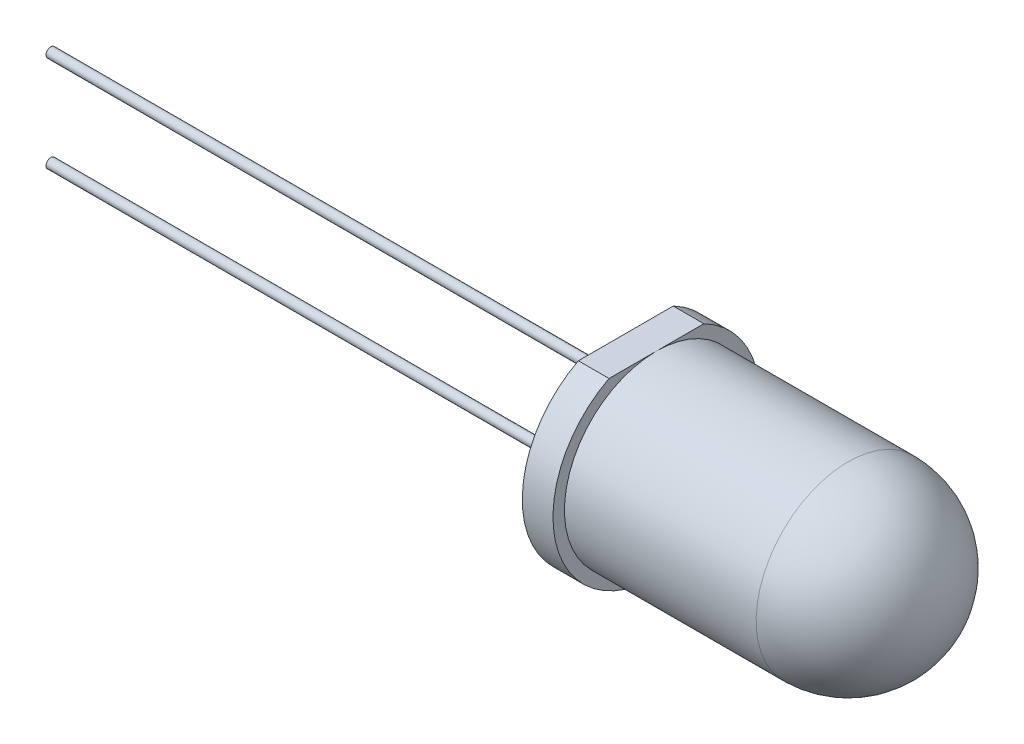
ISO-10303-21;
HEADER;
FILE_DESCRIPTION(('STEP AP214'),'2;1');
FILE_NAME('part.step','',(''),(''),'','','');
FILE_SCHEMA(('AUTOMOTIVE_DESIGN { 1 0 10303 214 1 1 1 1 }'));
ENDSEC;
DATA;
#1=APPLICATION_CONTEXT('core data for automotive mechanical design processes');
#2=APPLICATION_PROTOCOL_DEFINITION('international standard','automotive_design',2000,#1);
#3=PRODUCT_CONTEXT('',#1,'mechanical');
#4=PRODUCT('Part','Part','',(#3));
#5=PRODUCT_RELATED_PRODUCT_CATEGORY('part','',(#4));
#6=PRODUCT_DEFINITION_FORMATION('','',#4);
#7=PRODUCT_DEFINITION_CONTEXT('part definition',#1,'design');
#8=PRODUCT_DEFINITION('design','',#6,#7);
#9=PRODUCT_DEFINITION_SHAPE('','',#8);
#10=(LENGTH_UNIT() NAMED_UNIT(*) SI_UNIT(.MILLI.,.METRE.));
#11=(NAMED_UNIT(*) PLANE_ANGLE_UNIT() SI_UNIT($,.RADIAN.));
#12=(NAMED_UNIT(*) SI_UNIT($,.STERADIAN.) SOLID_ANGLE_UNIT());
#13=UNCERTAINTY_MEASURE_WITH_UNIT(LENGTH_MEASURE(1.E-05),#10,'distance_accuracy_value','');
#14=(GEOMETRIC_REPRESENTATION_CONTEXT(3) GLOBAL_UNCERTAINTY_ASSIGNED_CONTEXT((#13)) GLOBAL_UNIT_ASSIGNED_CONTEXT((#10,
#11,#12)) REPRESENTATION_CONTEXT('',''));
#15=CARTESIAN_POINT('',(0.,0.,0.));
#16=DIRECTION('',(0.,0.,1.));
#17=DIRECTION('',(1.,0.,0.));
#18=AXIS2_PLACEMENT_3D('',#15,#16,#17);
#19=CARTESIAN_POINT('',(-0.8,0.,0.));
#20=DIRECTION('',(1.,0.,0.));
#21=DIRECTION('',(0.,0.,-1.));
#22=AXIS2_PLACEMENT_3D('',#19,#20,#21);
#23=CYLINDRICAL_SURFACE('',#22,2.4);
#24=CARTESIAN_POINT('',(0.,0.,0.));
#25=DIRECTION('',(1.,0.,0.));
#26=DIRECTION('',(0.,0.,-1.));
#27=AXIS2_PLACEMENT_3D('',#24,#25,#26);
#28=CIRCLE('',#27,2.4);
#29=CARTESIAN_POINT('',(0.,2.4,0.));
#30=VERTEX_POINT('',#29);
#31=EDGE_CURVE('E95',#30,#30,#28,.T.);
#32=ORIENTED_EDGE('',*,*,#31,.T.);
#33=EDGE_LOOP('',(#32));
#34=FACE_BOUND('',#33,.T.);
#35=CARTESIAN_POINT('',(5.,0.,0.));
#36=DIRECTION('',(1.,0.,0.));
#37=DIRECTION('',(0.,0.,-1.));
#38=AXIS2_PLACEMENT_3D('',#35,#36,#37);
#39=CIRCLE('',#38,2.4);
#40=CARTESIAN_POINT('',(5.,0.,-2.4));
#41=VERTEX_POINT('',#40);
#42=EDGE_CURVE('E102',#41,#41,#39,.T.);
#43=ORIENTED_EDGE('',*,*,#42,.F.);
#44=EDGE_LOOP('',(#43));
#45=FACE_BOUND('',#44,.T.);
#46=ADVANCED_FACE('F53',(#34,#45),#23,.T.);
#47=CARTESIAN_POINT('',(5.,0.,0.));
#48=DIRECTION('',(1.,0.,0.));
#49=DIRECTION('',(0.,-1.,0.));
#50=AXIS2_PLACEMENT_3D('',#47,#48,#49);
#51=SPHERICAL_SURFACE('',#50,2.4);
#52=ORIENTED_EDGE('',*,*,#42,.T.);
#53=EDGE_LOOP('',(#52));
#54=FACE_BOUND('',#53,.T.);
#55=ADVANCED_FACE('F115',(#54),#51,.T.);
#56=CARTESIAN_POINT('',(-0.8,2.7,0.));
#57=DIRECTION('',(-1.,0.,0.));
#58=DIRECTION('',(0.,0.,1.));
#59=AXIS2_PLACEMENT_3D('',#56,#57,#58);
#60=PLANE('',#59);
#61=DIRECTION('',(0.,0.,1.));
#62=VECTOR('',#61,1.);
#63=CARTESIAN_POINT('',(-0.8,2.4,0.));
#64=LINE('',#63,#62);
#65=CARTESIAN_POINT('',(-0.8,2.4,-1.2369316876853));
#66=VERTEX_POINT('',#65);
#67=CARTESIAN_POINT('',(-0.8,2.4,1.2369316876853));
#68=VERTEX_POINT('',#67);
#69=EDGE_CURVE('E82',#66,#68,#64,.T.);
#70=ORIENTED_EDGE('',*,*,#69,.F.);
#71=CARTESIAN_POINT('',(-0.8,0.,0.));
#72=DIRECTION('',(1.,0.,0.));
#73=DIRECTION('',(0.,0.,-1.));
#74=AXIS2_PLACEMENT_3D('',#71,#72,#73);
#75=CIRCLE('',#74,2.7);
#76=EDGE_CURVE('E98',#68,#66,#75,.T.);
#77=ORIENTED_EDGE('',*,*,#76,.F.);
#78=EDGE_LOOP('',(#70,#77));
#79=FACE_BOUND('',#78,.T.);
#80=CARTESIAN_POINT('',(-0.8,-1.25,0.));
#81=DIRECTION('',(-1.,0.,0.));
#82=DIRECTION('',(0.,0.,1.));
#83=AXIS2_PLACEMENT_3D('',#80,#81,#82);
#84=CIRCLE('',#83,0.125);
#85=CARTESIAN_POINT('',(-0.8,-1.25,0.125));
#86=VERTEX_POINT('',#85);
#87=EDGE_CURVE('E265',#86,#86,#84,.T.);
#88=ORIENTED_EDGE('',*,*,#87,.F.);
#89=EDGE_LOOP('',(#88));
#90=FACE_BOUND('',#89,.T.);
#91=CARTESIAN_POINT('',(-0.8,1.25,0.));
#92=DIRECTION('',(-1.,0.,0.));
#93=DIRECTION('',(0.,0.,1.));
#94=AXIS2_PLACEMENT_3D('',#91,#92,#93);
#95=CIRCLE('',#94,0.125);
#96=CARTESIAN_POINT('',(-0.8,1.25,0.125));
#97=VERTEX_POINT('',#96);
#98=EDGE_CURVE('E264',#97,#97,#95,.T.);
#99=ORIENTED_EDGE('',*,*,#98,.F.);
#100=EDGE_LOOP('',(#99));
#101=FACE_BOUND('',#100,.T.);
#102=ADVANCED_FACE('F119',(#79,#90,#101),#60,.T.);
#103=CARTESIAN_POINT('',(-0.8,0.,0.));
#104=DIRECTION('',(1.,0.,0.));
#105=DIRECTION('',(0.,0.,-1.));
#106=AXIS2_PLACEMENT_3D('',#103,#104,#105);
#107=CYLINDRICAL_SURFACE('',#106,2.7);
#108=DIRECTION('',(1.,0.,0.));
#109=VECTOR('',#108,1.);
#110=CARTESIAN_POINT('',(-0.8,2.4,-1.2369316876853));
#111=LINE('',#110,#109);
#112=CARTESIAN_POINT('',(0.,2.4,-1.2369316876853));
#113=VERTEX_POINT('',#112);
#114=EDGE_CURVE('E72',#113,#66,#111,.F.);
#115=ORIENTED_EDGE('',*,*,#114,.F.);
#116=CARTESIAN_POINT('',(0.,0.,0.));
#117=DIRECTION('',(1.,0.,0.));
#118=DIRECTION('',(0.,0.,-1.));
#119=AXIS2_PLACEMENT_3D('',#116,#117,#118);
#120=CIRCLE('',#119,2.7);
#121=CARTESIAN_POINT('',(0.,2.4,1.2369316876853));
#122=VERTEX_POINT('',#121);
#123=EDGE_CURVE('E93',#122,#113,#120,.T.);
#124=ORIENTED_EDGE('',*,*,#123,.F.);
#125=DIRECTION('',(1.,0.,0.));
#126=VECTOR('',#125,1.);
#127=CARTESIAN_POINT('',(-0.8,2.4,1.2369316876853));
#128=LINE('',#127,#126);
#129=EDGE_CURVE('E80',#68,#122,#128,.T.);
#130=ORIENTED_EDGE('',*,*,#129,.F.);
#131=ORIENTED_EDGE('',*,*,#76,.T.);
#132=EDGE_LOOP('',(#115,#124,#130,#131));
#133=FACE_BOUND('',#132,.T.);
#134=ADVANCED_FACE('F96',(#133),#107,.T.);
#135=CARTESIAN_POINT('',(0.,2.4,0.));
#136=DIRECTION('',(1.,0.,0.));
#137=DIRECTION('',(0.,0.,-1.));
#138=AXIS2_PLACEMENT_3D('',#135,#136,#137);
#139=PLANE('',#138);
#140=DIRECTION('',(0.,0.,-1.));
#141=VECTOR('',#140,1.);
#142=CARTESIAN_POINT('',(0.,2.4,0.));
#143=LINE('',#142,#141);
#144=EDGE_CURVE('E11',#122,#30,#143,.T.);
#145=ORIENTED_EDGE('',*,*,#144,.F.);
#146=ORIENTED_EDGE('',*,*,#123,.T.);
#147=EDGE_CURVE('E56',#30,#113,#143,.T.);
#148=ORIENTED_EDGE('',*,*,#147,.F.);
#149=ORIENTED_EDGE('',*,*,#31,.F.);
#150=EDGE_LOOP('',(#145,#146,#148,#149));
#151=FACE_BOUND('',#150,.T.);
#152=ADVANCED_FACE('F92',(#151),#139,.T.);
#153=CARTESIAN_POINT('',(-15.8,1.25,0.));
#154=DIRECTION('',(1.,0.,0.));
#155=DIRECTION('',(0.,0.,-1.));
#156=AXIS2_PLACEMENT_3D('',#153,#154,#155);
#157=CYLINDRICAL_SURFACE('',#156,0.125);
#158=CARTESIAN_POINT('',(-15.8,1.25,0.));
#159=DIRECTION('',(-1.,0.,0.));
#160=DIRECTION('',(0.,0.,1.));
#161=AXIS2_PLACEMENT_3D('',#158,#159,#160);
#162=CIRCLE('',#161,0.125);
#163=CARTESIAN_POINT('',(-15.8,1.25,0.125));
#164=VERTEX_POINT('',#163);
#165=EDGE_CURVE('E104',#164,#164,#162,.T.);
#166=ORIENTED_EDGE('',*,*,#165,.F.);
#167=EDGE_LOOP('',(#166));
#168=FACE_BOUND('',#167,.T.);
#169=ORIENTED_EDGE('',*,*,#98,.T.);
#170=EDGE_LOOP('',(#169));
#171=FACE_BOUND('',#170,.T.);
#172=ADVANCED_FACE('F130',(#168,#171),#157,.T.);
#173=CARTESIAN_POINT('',(-15.8,1.25,0.));
#174=DIRECTION('',(-1.,0.,0.));
#175=DIRECTION('',(0.,0.,1.));
#176=AXIS2_PLACEMENT_3D('',#173,#174,#175);
#177=PLANE('',#176);
#178=ORIENTED_EDGE('',*,*,#165,.T.);
#179=EDGE_LOOP('',(#178));
#180=FACE_BOUND('',#179,.T.);
#181=ADVANCED_FACE('F133',(#180),#177,.T.);
#182=CARTESIAN_POINT('',(-15.8,-1.25,0.));
#183=DIRECTION('',(1.,0.,0.));
#184=DIRECTION('',(0.,0.,-1.));
#185=AXIS2_PLACEMENT_3D('',#182,#183,#184);
#186=CYLINDRICAL_SURFACE('',#185,0.125);
#187=CARTESIAN_POINT('',(-15.8,-1.25,0.));
#188=DIRECTION('',(-1.,0.,0.));
#189=DIRECTION('',(0.,0.,1.));
#190=AXIS2_PLACEMENT_3D('',#187,#188,#189);
#191=CIRCLE('',#190,0.125);
#192=CARTESIAN_POINT('',(-15.8,-1.25,0.125));
#193=VERTEX_POINT('',#192);
#194=EDGE_CURVE('E262',#193,#193,#191,.T.);
#195=ORIENTED_EDGE('',*,*,#194,.F.);
#196=EDGE_LOOP('',(#195));
#197=FACE_BOUND('',#196,.T.);
#198=ORIENTED_EDGE('',*,*,#87,.T.);
#199=EDGE_LOOP('',(#198));
#200=FACE_BOUND('',#199,.T.);
#201=ADVANCED_FACE('F137',(#197,#200),#186,.T.);
#202=CARTESIAN_POINT('',(-15.8,-1.25,0.));
#203=DIRECTION('',(-1.,0.,0.));
#204=DIRECTION('',(0.,0.,1.));
#205=AXIS2_PLACEMENT_3D('',#202,#203,#204);
#206=PLANE('',#205);
#207=ORIENTED_EDGE('',*,*,#194,.T.);
#208=EDGE_LOOP('',(#207));
#209=FACE_BOUND('',#208,.T.);
#210=ADVANCED_FACE('F141',(#209),#206,.T.);
#211=CARTESIAN_POINT('',(-15.8,2.4,2.0941833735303));
#212=DIRECTION('',(0.,-1.,0.));
#213=DIRECTION('',(0.,0.,-1.));
#214=AXIS2_PLACEMENT_3D('',#211,#212,#213);
#215=PLANE('',#214);
#216=ORIENTED_EDGE('',*,*,#114,.T.);
#217=ORIENTED_EDGE('',*,*,#69,.T.);
#218=ORIENTED_EDGE('',*,*,#129,.T.);
#219=ORIENTED_EDGE('',*,*,#144,.T.);
#220=ORIENTED_EDGE('',*,*,#147,.T.);
#221=EDGE_LOOP('',(#216,#217,#218,#219,#220));
#222=FACE_BOUND('',#221,.T.);
#223=ADVANCED_FACE('F81',(#222),#215,.F.);
#224=CLOSED_SHELL('',(#46,#55,#102,#134,#152,#172,#181,#201,#210,#223));
#225=MANIFOLD_SOLID_BREP('B2',#224);
#226=ADVANCED_BREP_SHAPE_REPRESENTATION('',(#18,#225),#14);
#227=SHAPE_DEFINITION_REPRESENTATION(#9,#226);
ENDSEC;
END-ISO-10303-21;
